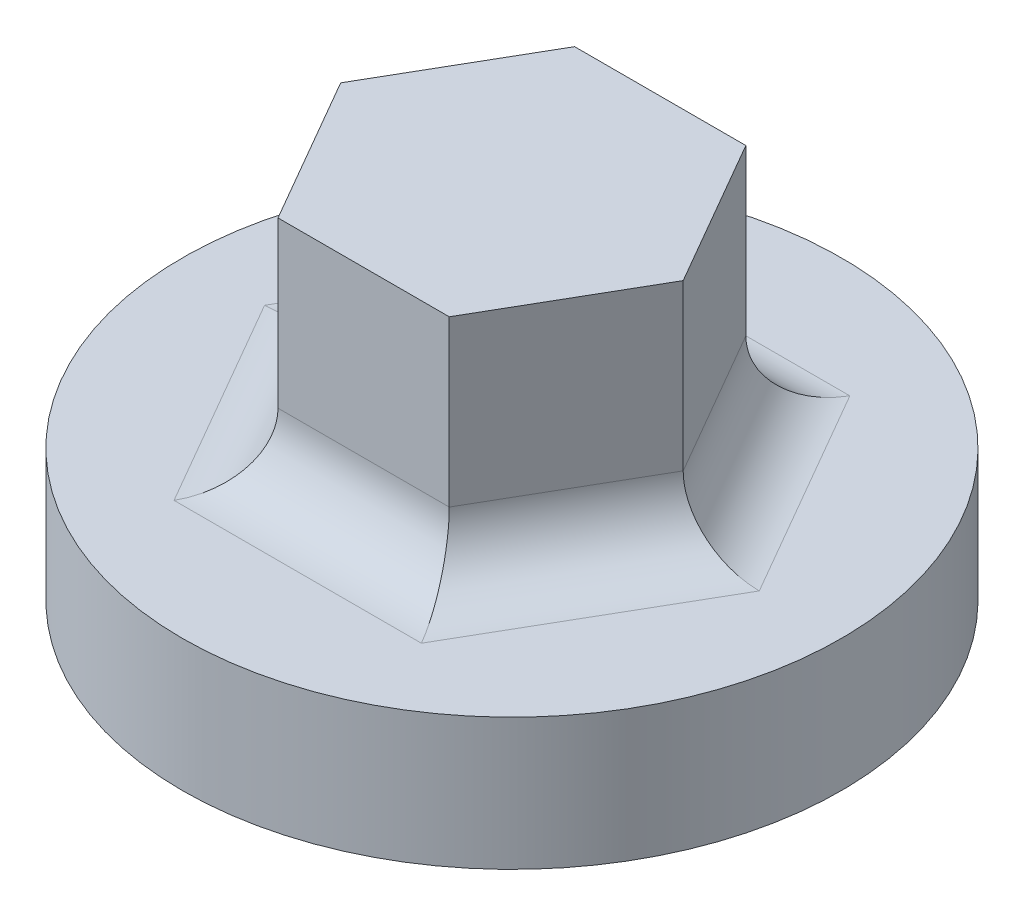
ISO-10303-21;
HEADER;
FILE_DESCRIPTION(('STEP AP214'),'2;1');
FILE_NAME('part.step','',(''),(''),'','','');
FILE_SCHEMA(('AUTOMOTIVE_DESIGN { 1 0 10303 214 1 1 1 1 }'));
ENDSEC;
DATA;
#1=APPLICATION_CONTEXT('core data for automotive mechanical design processes');
#2=APPLICATION_PROTOCOL_DEFINITION('international standard','automotive_design',2000,#1);
#3=PRODUCT_CONTEXT('',#1,'mechanical');
#4=PRODUCT('Part','Part','',(#3));
#5=PRODUCT_RELATED_PRODUCT_CATEGORY('part','',(#4));
#6=PRODUCT_DEFINITION_FORMATION('','',#4);
#7=PRODUCT_DEFINITION_CONTEXT('part definition',#1,'design');
#8=PRODUCT_DEFINITION('design','',#6,#7);
#9=PRODUCT_DEFINITION_SHAPE('','',#8);
#10=(LENGTH_UNIT() NAMED_UNIT(*) SI_UNIT(.MILLI.,.METRE.));
#11=(NAMED_UNIT(*) PLANE_ANGLE_UNIT() SI_UNIT($,.RADIAN.));
#12=(NAMED_UNIT(*) SI_UNIT($,.STERADIAN.) SOLID_ANGLE_UNIT());
#13=UNCERTAINTY_MEASURE_WITH_UNIT(LENGTH_MEASURE(1.E-05),#10,'distance_accuracy_value','');
#14=(GEOMETRIC_REPRESENTATION_CONTEXT(3) GLOBAL_UNCERTAINTY_ASSIGNED_CONTEXT((#13)) GLOBAL_UNIT_ASSIGNED_CONTEXT((#10,
#11,#12)) REPRESENTATION_CONTEXT('',''));
#15=CARTESIAN_POINT('',(0.,0.,0.));
#16=DIRECTION('',(0.,0.,1.));
#17=DIRECTION('',(1.,0.,0.));
#18=AXIS2_PLACEMENT_3D('',#15,#16,#17);
#19=CARTESIAN_POINT('',(0.,20.,0.));
#20=DIRECTION('',(0.,1.,0.));
#21=DIRECTION('',(0.,0.,1.));
#22=AXIS2_PLACEMENT_3D('',#19,#20,#21);
#23=PLANE('',#22);
#24=DIRECTION('',(1.,0.,0.));
#25=VECTOR('',#24,1.);
#26=CARTESIAN_POINT('',(0.,20.,32.5));
#27=LINE('',#26,#25);
#28=CARTESIAN_POINT('',(18.7638837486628,20.,32.5));
#29=VERTEX_POINT('',#28);
#30=CARTESIAN_POINT('',(-18.7638837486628,20.,32.5));
#31=VERTEX_POINT('',#30);
#32=EDGE_CURVE('E144',#29,#31,#27,.F.);
#33=ORIENTED_EDGE('',*,*,#32,.T.);
#34=DIRECTION('',(0.5,0.,0.866025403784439));
#35=VECTOR('',#34,1.);
#36=CARTESIAN_POINT('',(-28.1458256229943,20.,16.25));
#37=LINE('',#36,#35);
#38=CARTESIAN_POINT('',(-37.5277674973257,20.,0.));
#39=VERTEX_POINT('',#38);
#40=EDGE_CURVE('E152',#31,#39,#37,.F.);
#41=ORIENTED_EDGE('',*,*,#40,.T.);
#42=DIRECTION('',(-0.5,0.,0.866025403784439));
#43=VECTOR('',#42,1.);
#44=CARTESIAN_POINT('',(-28.1458256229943,20.,-16.25));
#45=LINE('',#44,#43);
#46=CARTESIAN_POINT('',(-18.7638837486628,20.,-32.5));
#47=VERTEX_POINT('',#46);
#48=EDGE_CURVE('E150',#39,#47,#45,.F.);
#49=ORIENTED_EDGE('',*,*,#48,.T.);
#50=DIRECTION('',(-1.,0.,0.));
#51=VECTOR('',#50,1.);
#52=CARTESIAN_POINT('',(0.,20.,-32.5));
#53=LINE('',#52,#51);
#54=CARTESIAN_POINT('',(18.7638837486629,20.,-32.5));
#55=VERTEX_POINT('',#54);
#56=EDGE_CURVE('E148',#47,#55,#53,.F.);
#57=ORIENTED_EDGE('',*,*,#56,.T.);
#58=DIRECTION('',(-0.5,0.,-0.866025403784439));
#59=VECTOR('',#58,1.);
#60=CARTESIAN_POINT('',(28.1458256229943,20.,-16.25));
#61=LINE('',#60,#59);
#62=CARTESIAN_POINT('',(37.5277674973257,20.,0.));
#63=VERTEX_POINT('',#62);
#64=EDGE_CURVE('E146',#55,#63,#61,.F.);
#65=ORIENTED_EDGE('',*,*,#64,.T.);
#66=DIRECTION('',(0.5,0.,-0.866025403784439));
#67=VECTOR('',#66,1.);
#68=CARTESIAN_POINT('',(28.1458256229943,20.,16.25));
#69=LINE('',#68,#67);
#70=EDGE_CURVE('E142',#63,#29,#69,.F.);
#71=ORIENTED_EDGE('',*,*,#70,.T.);
#72=EDGE_LOOP('',(#33,#41,#49,#57,#65,#71));
#73=FACE_BOUND('',#72,.T.);
#74=CARTESIAN_POINT('',(0.,20.,0.));
#75=DIRECTION('',(0.,1.,0.));
#76=DIRECTION('',(0.,0.,1.));
#77=AXIS2_PLACEMENT_3D('',#74,#75,#76);
#78=CIRCLE('',#77,50.);
#79=CARTESIAN_POINT('',(0.,20.,50.));
#80=VERTEX_POINT('',#79);
#81=EDGE_CURVE('E132',#80,#80,#78,.T.);
#82=ORIENTED_EDGE('',*,*,#81,.T.);
#83=EDGE_LOOP('',(#82));
#84=FACE_BOUND('',#83,.T.);
#85=ADVANCED_FACE('F32',(#73,#84),#23,.T.);
#86=CARTESIAN_POINT('',(0.,20.,0.));
#87=DIRECTION('',(0.,-1.,0.));
#88=DIRECTION('',(0.,0.,-1.));
#89=AXIS2_PLACEMENT_3D('',#86,#87,#88);
#90=CYLINDRICAL_SURFACE('',#89,50.);
#91=ORIENTED_EDGE('',*,*,#81,.F.);
#92=EDGE_LOOP('',(#91));
#93=FACE_BOUND('',#92,.T.);
#94=CARTESIAN_POINT('',(0.,0.,0.));
#95=DIRECTION('',(0.,1.,0.));
#96=DIRECTION('',(0.,0.,1.));
#97=AXIS2_PLACEMENT_3D('',#94,#95,#96);
#98=CIRCLE('',#97,50.);
#99=CARTESIAN_POINT('',(0.,0.,50.));
#100=VERTEX_POINT('',#99);
#101=EDGE_CURVE('E129',#100,#100,#98,.T.);
#102=ORIENTED_EDGE('',*,*,#101,.T.);
#103=EDGE_LOOP('',(#102));
#104=FACE_BOUND('',#103,.T.);
#105=ADVANCED_FACE('F225',(#93,#104),#90,.T.);
#106=CARTESIAN_POINT('',(0.,0.,0.));
#107=DIRECTION('',(0.,1.,0.));
#108=DIRECTION('',(0.,0.,1.));
#109=AXIS2_PLACEMENT_3D('',#106,#107,#108);
#110=PLANE('',#109);
#111=ORIENTED_EDGE('',*,*,#101,.F.);
#112=EDGE_LOOP('',(#111));
#113=FACE_BOUND('',#112,.T.);
#114=ADVANCED_FACE('F230',(#113),#110,.F.);
#115=CARTESIAN_POINT('',(-12.9903810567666,55.,-22.5));
#116=DIRECTION('',(0.866025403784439,0.,0.5));
#117=DIRECTION('',(0.5,0.,-0.866025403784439));
#118=AXIS2_PLACEMENT_3D('',#115,#116,#117);
#119=PLANE('',#118);
#120=DIRECTION('',(0.,-1.,0.));
#121=VECTOR('',#120,1.);
#122=CARTESIAN_POINT('',(-12.9903810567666,55.,-22.5));
#123=LINE('',#122,#121);
#124=CARTESIAN_POINT('',(-12.9903810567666,55.,-22.5));
#125=VERTEX_POINT('',#124);
#126=CARTESIAN_POINT('',(-12.9903810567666,30.,-22.5));
#127=VERTEX_POINT('',#126);
#128=EDGE_CURVE('E205',#125,#127,#123,.T.);
#129=ORIENTED_EDGE('',*,*,#128,.T.);
#130=DIRECTION('',(-0.5,0.,0.866025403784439));
#131=VECTOR('',#130,1.);
#132=CARTESIAN_POINT('',(-12.9903810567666,30.,-22.5));
#133=LINE('',#132,#131);
#134=CARTESIAN_POINT('',(-25.9807621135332,30.,0.));
#135=VERTEX_POINT('',#134);
#136=EDGE_CURVE('E128',#127,#135,#133,.T.);
#137=ORIENTED_EDGE('',*,*,#136,.T.);
#138=DIRECTION('',(0.,-1.,0.));
#139=VECTOR('',#138,1.);
#140=CARTESIAN_POINT('',(-25.9807621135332,55.,0.));
#141=LINE('',#140,#139);
#142=CARTESIAN_POINT('',(-25.9807621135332,55.,0.));
#143=VERTEX_POINT('',#142);
#144=EDGE_CURVE('E110',#143,#135,#141,.T.);
#145=ORIENTED_EDGE('',*,*,#144,.F.);
#146=DIRECTION('',(-0.5,0.,0.866025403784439));
#147=VECTOR('',#146,1.);
#148=CARTESIAN_POINT('',(-12.9903810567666,55.,-22.5));
#149=LINE('',#148,#147);
#150=EDGE_CURVE('E116',#125,#143,#149,.T.);
#151=ORIENTED_EDGE('',*,*,#150,.F.);
#152=EDGE_LOOP('',(#129,#137,#145,#151));
#153=FACE_BOUND('',#152,.T.);
#154=ADVANCED_FACE('F126',(#153),#119,.F.);
#155=CARTESIAN_POINT('',(-25.9807621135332,55.,0.));
#156=DIRECTION('',(0.866025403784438,0.,-0.5));
#157=DIRECTION('',(-0.5,0.,-0.866025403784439));
#158=AXIS2_PLACEMENT_3D('',#155,#156,#157);
#159=PLANE('',#158);
#160=ORIENTED_EDGE('',*,*,#144,.T.);
#161=DIRECTION('',(0.5,0.,0.866025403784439));
#162=VECTOR('',#161,1.);
#163=CARTESIAN_POINT('',(-25.9807621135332,30.,0.));
#164=LINE('',#163,#162);
#165=CARTESIAN_POINT('',(-12.9903810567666,30.,22.5));
#166=VERTEX_POINT('',#165);
#167=EDGE_CURVE('E139',#135,#166,#164,.T.);
#168=ORIENTED_EDGE('',*,*,#167,.T.);
#169=DIRECTION('',(0.,-1.,0.));
#170=VECTOR('',#169,1.);
#171=CARTESIAN_POINT('',(-12.9903810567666,55.,22.5));
#172=LINE('',#171,#170);
#173=CARTESIAN_POINT('',(-12.9903810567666,55.,22.5));
#174=VERTEX_POINT('',#173);
#175=EDGE_CURVE('E112',#174,#166,#172,.T.);
#176=ORIENTED_EDGE('',*,*,#175,.F.);
#177=DIRECTION('',(0.5,0.,0.866025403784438));
#178=VECTOR('',#177,1.);
#179=CARTESIAN_POINT('',(-25.9807621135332,55.,0.));
#180=LINE('',#179,#178);
#181=EDGE_CURVE('E105',#143,#174,#180,.T.);
#182=ORIENTED_EDGE('',*,*,#181,.F.);
#183=EDGE_LOOP('',(#160,#168,#176,#182));
#184=FACE_BOUND('',#183,.T.);
#185=ADVANCED_FACE('F107',(#184),#159,.F.);
#186=CARTESIAN_POINT('',(-12.9903810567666,55.,22.5));
#187=DIRECTION('',(0.,0.,-1.));
#188=DIRECTION('',(-1.,0.,0.));
#189=AXIS2_PLACEMENT_3D('',#186,#187,#188);
#190=PLANE('',#189);
#191=ORIENTED_EDGE('',*,*,#175,.T.);
#192=DIRECTION('',(1.,0.,0.));
#193=VECTOR('',#192,1.);
#194=CARTESIAN_POINT('',(-12.9903810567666,30.,22.5));
#195=LINE('',#194,#193);
#196=CARTESIAN_POINT('',(12.9903810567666,30.,22.5));
#197=VERTEX_POINT('',#196);
#198=EDGE_CURVE('E41',#166,#197,#195,.T.);
#199=ORIENTED_EDGE('',*,*,#198,.T.);
#200=DIRECTION('',(0.,-1.,0.));
#201=VECTOR('',#200,1.);
#202=CARTESIAN_POINT('',(12.9903810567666,55.,22.5));
#203=LINE('',#202,#201);
#204=CARTESIAN_POINT('',(12.9903810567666,55.,22.5));
#205=VERTEX_POINT('',#204);
#206=EDGE_CURVE('E134',#205,#197,#203,.T.);
#207=ORIENTED_EDGE('',*,*,#206,.F.);
#208=DIRECTION('',(1.,0.,0.));
#209=VECTOR('',#208,1.);
#210=CARTESIAN_POINT('',(-12.9903810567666,55.,22.5));
#211=LINE('',#210,#209);
#212=EDGE_CURVE('E115',#174,#205,#211,.T.);
#213=ORIENTED_EDGE('',*,*,#212,.F.);
#214=EDGE_LOOP('',(#191,#199,#207,#213));
#215=FACE_BOUND('',#214,.T.);
#216=ADVANCED_FACE('F196',(#215),#190,.F.);
#217=CARTESIAN_POINT('',(12.9903810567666,55.,22.5));
#218=DIRECTION('',(-0.866025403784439,0.,-0.5));
#219=DIRECTION('',(-0.5,0.,0.866025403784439));
#220=AXIS2_PLACEMENT_3D('',#217,#218,#219);
#221=PLANE('',#220);
#222=ORIENTED_EDGE('',*,*,#206,.T.);
#223=DIRECTION('',(0.5,0.,-0.866025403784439));
#224=VECTOR('',#223,1.);
#225=CARTESIAN_POINT('',(12.9903810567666,30.,22.5));
#226=LINE('',#225,#224);
#227=CARTESIAN_POINT('',(25.9807621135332,30.,0.));
#228=VERTEX_POINT('',#227);
#229=EDGE_CURVE('E11',#197,#228,#226,.T.);
#230=ORIENTED_EDGE('',*,*,#229,.T.);
#231=DIRECTION('',(0.,-1.,0.));
#232=VECTOR('',#231,1.);
#233=CARTESIAN_POINT('',(25.9807621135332,55.,0.));
#234=LINE('',#233,#232);
#235=CARTESIAN_POINT('',(25.9807621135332,55.,0.));
#236=VERTEX_POINT('',#235);
#237=EDGE_CURVE('E210',#236,#228,#234,.T.);
#238=ORIENTED_EDGE('',*,*,#237,.F.);
#239=DIRECTION('',(0.5,0.,-0.866025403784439));
#240=VECTOR('',#239,1.);
#241=CARTESIAN_POINT('',(12.9903810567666,55.,22.5));
#242=LINE('',#241,#240);
#243=EDGE_CURVE('E198',#205,#236,#242,.T.);
#244=ORIENTED_EDGE('',*,*,#243,.F.);
#245=EDGE_LOOP('',(#222,#230,#238,#244));
#246=FACE_BOUND('',#245,.T.);
#247=ADVANCED_FACE('F211',(#246),#221,.F.);
#248=CARTESIAN_POINT('',(25.9807621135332,55.,0.));
#249=DIRECTION('',(-0.866025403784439,0.,0.5));
#250=DIRECTION('',(0.5,0.,0.866025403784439));
#251=AXIS2_PLACEMENT_3D('',#248,#249,#250);
#252=PLANE('',#251);
#253=ORIENTED_EDGE('',*,*,#237,.T.);
#254=DIRECTION('',(-0.5,0.,-0.866025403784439));
#255=VECTOR('',#254,1.);
#256=CARTESIAN_POINT('',(25.9807621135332,30.,0.));
#257=LINE('',#256,#255);
#258=CARTESIAN_POINT('',(12.9903810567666,30.,-22.5));
#259=VERTEX_POINT('',#258);
#260=EDGE_CURVE('E158',#228,#259,#257,.T.);
#261=ORIENTED_EDGE('',*,*,#260,.T.);
#262=DIRECTION('',(0.,-1.,0.));
#263=VECTOR('',#262,1.);
#264=CARTESIAN_POINT('',(12.9903810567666,55.,-22.5));
#265=LINE('',#264,#263);
#266=CARTESIAN_POINT('',(12.9903810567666,55.,-22.5));
#267=VERTEX_POINT('',#266);
#268=EDGE_CURVE('E207',#267,#259,#265,.T.);
#269=ORIENTED_EDGE('',*,*,#268,.F.);
#270=DIRECTION('',(-0.5,0.,-0.866025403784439));
#271=VECTOR('',#270,1.);
#272=CARTESIAN_POINT('',(25.9807621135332,55.,0.));
#273=LINE('',#272,#271);
#274=EDGE_CURVE('E200',#236,#267,#273,.T.);
#275=ORIENTED_EDGE('',*,*,#274,.F.);
#276=EDGE_LOOP('',(#253,#261,#269,#275));
#277=FACE_BOUND('',#276,.T.);
#278=ADVANCED_FACE('F253',(#277),#252,.F.);
#279=CARTESIAN_POINT('',(12.9903810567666,55.,-22.5));
#280=DIRECTION('',(0.,0.,1.));
#281=DIRECTION('',(1.,0.,0.));
#282=AXIS2_PLACEMENT_3D('',#279,#280,#281);
#283=PLANE('',#282);
#284=ORIENTED_EDGE('',*,*,#268,.T.);
#285=DIRECTION('',(-1.,0.,0.));
#286=VECTOR('',#285,1.);
#287=CARTESIAN_POINT('',(12.9903810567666,30.,-22.5));
#288=LINE('',#287,#286);
#289=EDGE_CURVE('E156',#259,#127,#288,.T.);
#290=ORIENTED_EDGE('',*,*,#289,.T.);
#291=ORIENTED_EDGE('',*,*,#128,.F.);
#292=DIRECTION('',(-1.,0.,0.));
#293=VECTOR('',#292,1.);
#294=CARTESIAN_POINT('',(12.9903810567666,55.,-22.5));
#295=LINE('',#294,#293);
#296=EDGE_CURVE('E121',#267,#125,#295,.T.);
#297=ORIENTED_EDGE('',*,*,#296,.F.);
#298=EDGE_LOOP('',(#284,#290,#291,#297));
#299=FACE_BOUND('',#298,.T.);
#300=ADVANCED_FACE('F256',(#299),#283,.F.);
#301=CARTESIAN_POINT('',(-38.9711431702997,55.,22.5));
#302=DIRECTION('',(0.,1.,0.));
#303=DIRECTION('',(0.,0.,1.));
#304=AXIS2_PLACEMENT_3D('',#301,#302,#303);
#305=PLANE('',#304);
#306=ORIENTED_EDGE('',*,*,#150,.T.);
#307=ORIENTED_EDGE('',*,*,#181,.T.);
#308=ORIENTED_EDGE('',*,*,#212,.T.);
#309=ORIENTED_EDGE('',*,*,#243,.T.);
#310=ORIENTED_EDGE('',*,*,#274,.T.);
#311=ORIENTED_EDGE('',*,*,#296,.T.);
#312=EDGE_LOOP('',(#306,#307,#308,#309,#310,#311));
#313=FACE_BOUND('',#312,.T.);
#314=ADVANCED_FACE('F119',(#313),#305,.T.);
#315=CARTESIAN_POINT('',(34.6410161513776,30.,-5.));
#316=DIRECTION('',(-0.5,0.,-0.866025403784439));
#317=DIRECTION('',(-0.866025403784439,0.,0.5));
#318=AXIS2_PLACEMENT_3D('',#315,#316,#317);
#319=CYLINDRICAL_SURFACE('',#318,10.);
#320=CARTESIAN_POINT('',(37.5277674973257,30.,0.));
#321=DIRECTION('',(0.,0.,-1.));
#322=DIRECTION('',(1.,0.,0.));
#323=AXIS2_PLACEMENT_3D('',#320,#321,#322);
#324=ELLIPSE('',#323,11.5470053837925,10.);
#325=EDGE_CURVE('E170',#63,#228,#324,.T.);
#326=ORIENTED_EDGE('',*,*,#325,.F.);
#327=ORIENTED_EDGE('',*,*,#64,.F.);
#328=CARTESIAN_POINT('',(18.7638837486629,30.,-32.5));
#329=DIRECTION('',(-0.866025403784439,0.,-0.5));
#330=DIRECTION('',(0.5,0.,-0.866025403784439));
#331=AXIS2_PLACEMENT_3D('',#328,#329,#330);
#332=ELLIPSE('',#331,11.5470053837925,10.);
#333=EDGE_CURVE('E36',#259,#55,#332,.F.);
#334=ORIENTED_EDGE('',*,*,#333,.F.);
#335=ORIENTED_EDGE('',*,*,#260,.F.);
#336=EDGE_LOOP('',(#326,#327,#334,#335));
#337=FACE_BOUND('',#336,.T.);
#338=ADVANCED_FACE('F34',(#337),#319,.F.);
#339=CARTESIAN_POINT('',(12.9903810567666,30.,-32.5));
#340=DIRECTION('',(-1.,0.,0.));
#341=DIRECTION('',(0.,0.,1.));
#342=AXIS2_PLACEMENT_3D('',#339,#340,#341);
#343=CYLINDRICAL_SURFACE('',#342,10.);
#344=ORIENTED_EDGE('',*,*,#333,.T.);
#345=ORIENTED_EDGE('',*,*,#56,.F.);
#346=CARTESIAN_POINT('',(-18.7638837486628,30.,-32.5));
#347=DIRECTION('',(-0.866025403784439,0.,0.5));
#348=DIRECTION('',(-0.5,0.,-0.866025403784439));
#349=AXIS2_PLACEMENT_3D('',#346,#347,#348);
#350=ELLIPSE('',#349,11.5470053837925,10.);
#351=EDGE_CURVE('E168',#127,#47,#350,.F.);
#352=ORIENTED_EDGE('',*,*,#351,.F.);
#353=ORIENTED_EDGE('',*,*,#289,.F.);
#354=EDGE_LOOP('',(#344,#345,#352,#353));
#355=FACE_BOUND('',#354,.T.);
#356=ADVANCED_FACE('F180',(#355),#343,.F.);
#357=CARTESIAN_POINT('',(21.650635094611,30.,27.5));
#358=DIRECTION('',(0.5,0.,-0.866025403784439));
#359=DIRECTION('',(-0.866025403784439,0.,-0.5));
#360=AXIS2_PLACEMENT_3D('',#357,#358,#359);
#361=CYLINDRICAL_SURFACE('',#360,10.);
#362=ORIENTED_EDGE('',*,*,#325,.T.);
#363=ORIENTED_EDGE('',*,*,#229,.F.);
#364=CARTESIAN_POINT('',(18.7638837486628,30.,32.5));
#365=DIRECTION('',(0.866025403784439,0.,-0.5));
#366=DIRECTION('',(-0.5,0.,-0.866025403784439));
#367=AXIS2_PLACEMENT_3D('',#364,#365,#366);
#368=ELLIPSE('',#367,11.5470053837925,10.);
#369=EDGE_CURVE('E165',#29,#197,#368,.T.);
#370=ORIENTED_EDGE('',*,*,#369,.F.);
#371=ORIENTED_EDGE('',*,*,#70,.F.);
#372=EDGE_LOOP('',(#362,#363,#370,#371));
#373=FACE_BOUND('',#372,.T.);
#374=ADVANCED_FACE('F212',(#373),#361,.F.);
#375=CARTESIAN_POINT('',(-21.650635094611,30.,-27.5));
#376=DIRECTION('',(-0.5,0.,0.866025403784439));
#377=DIRECTION('',(0.866025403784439,0.,0.5));
#378=AXIS2_PLACEMENT_3D('',#375,#376,#377);
#379=CYLINDRICAL_SURFACE('',#378,10.);
#380=ORIENTED_EDGE('',*,*,#351,.T.);
#381=ORIENTED_EDGE('',*,*,#48,.F.);
#382=CARTESIAN_POINT('',(-37.5277674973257,30.,0.));
#383=DIRECTION('',(0.,0.,1.));
#384=DIRECTION('',(-1.,0.,0.));
#385=AXIS2_PLACEMENT_3D('',#382,#383,#384);
#386=ELLIPSE('',#385,11.5470053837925,10.);
#387=EDGE_CURVE('E163',#135,#39,#386,.F.);
#388=ORIENTED_EDGE('',*,*,#387,.F.);
#389=ORIENTED_EDGE('',*,*,#136,.F.);
#390=EDGE_LOOP('',(#380,#381,#388,#389));
#391=FACE_BOUND('',#390,.T.);
#392=ADVANCED_FACE('F191',(#391),#379,.F.);
#393=CARTESIAN_POINT('',(-12.9903810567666,30.,32.5));
#394=DIRECTION('',(1.,0.,0.));
#395=DIRECTION('',(0.,0.,-1.));
#396=AXIS2_PLACEMENT_3D('',#393,#394,#395);
#397=CYLINDRICAL_SURFACE('',#396,10.);
#398=ORIENTED_EDGE('',*,*,#369,.T.);
#399=ORIENTED_EDGE('',*,*,#198,.F.);
#400=CARTESIAN_POINT('',(-18.7638837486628,30.,32.5));
#401=DIRECTION('',(0.866025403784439,0.,0.5));
#402=DIRECTION('',(0.5,0.,-0.866025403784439));
#403=AXIS2_PLACEMENT_3D('',#400,#401,#402);
#404=ELLIPSE('',#403,11.5470053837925,10.);
#405=EDGE_CURVE('E161',#31,#166,#404,.T.);
#406=ORIENTED_EDGE('',*,*,#405,.F.);
#407=ORIENTED_EDGE('',*,*,#32,.F.);
#408=EDGE_LOOP('',(#398,#399,#406,#407));
#409=FACE_BOUND('',#408,.T.);
#410=ADVANCED_FACE('F215',(#409),#397,.F.);
#411=CARTESIAN_POINT('',(-34.6410161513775,30.,5.00000000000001));
#412=DIRECTION('',(0.5,0.,0.866025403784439));
#413=DIRECTION('',(0.866025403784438,0.,-0.5));
#414=AXIS2_PLACEMENT_3D('',#411,#412,#413);
#415=CYLINDRICAL_SURFACE('',#414,10.);
#416=ORIENTED_EDGE('',*,*,#387,.T.);
#417=ORIENTED_EDGE('',*,*,#40,.F.);
#418=ORIENTED_EDGE('',*,*,#405,.T.);
#419=ORIENTED_EDGE('',*,*,#167,.F.);
#420=EDGE_LOOP('',(#416,#417,#418,#419));
#421=FACE_BOUND('',#420,.T.);
#422=ADVANCED_FACE('F194',(#421),#415,.F.);
#423=CLOSED_SHELL('',(#85,#105,#114,#154,#185,#216,#247,#278,#300,#314,#338,#356,#374,#392,#410,#422));
#424=MANIFOLD_SOLID_BREP('B2',#423);
#425=ADVANCED_BREP_SHAPE_REPRESENTATION('',(#18,#424),#14);
#426=SHAPE_DEFINITION_REPRESENTATION(#9,#425);
ENDSEC;
END-ISO-10303-21;
